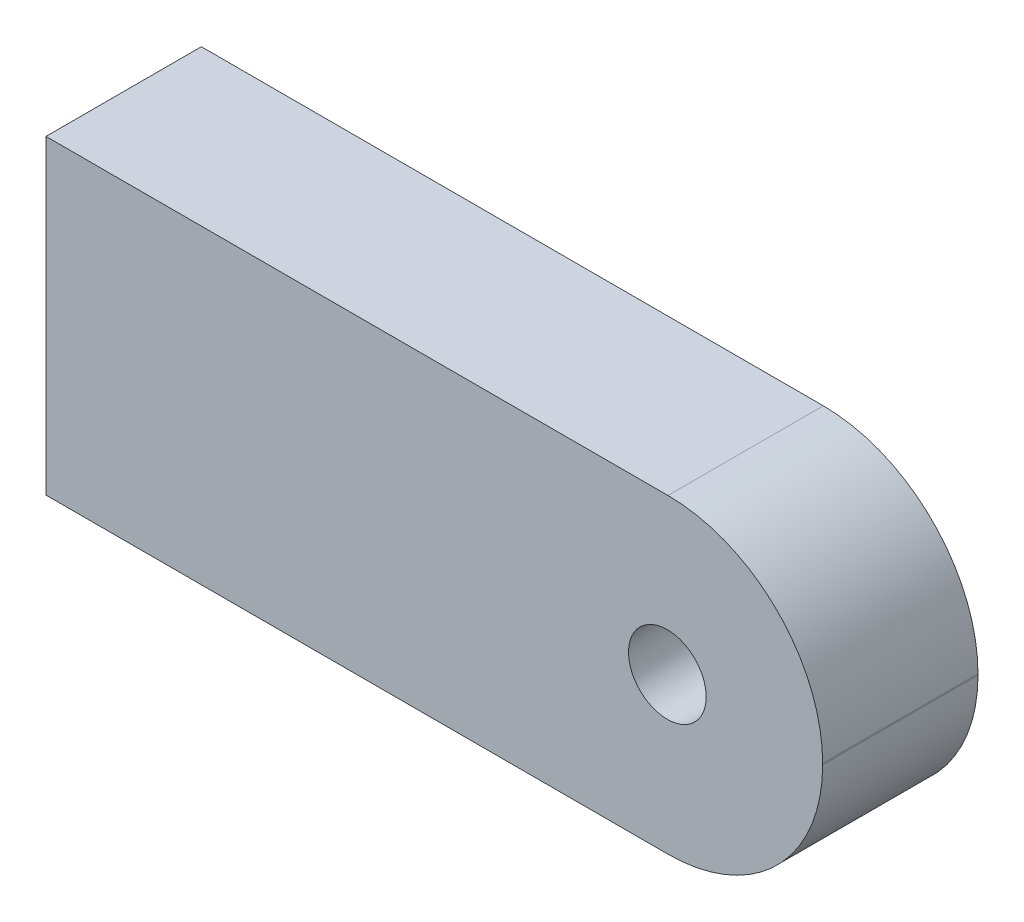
ISO-10303-21;
HEADER;
FILE_DESCRIPTION(('STEP AP214'),'2;1');
FILE_NAME('part.step','',(''),(''),'','','');
FILE_SCHEMA(('AUTOMOTIVE_DESIGN { 1 0 10303 214 1 1 1 1 }'));
ENDSEC;
DATA;
#1=APPLICATION_CONTEXT('core data for automotive mechanical design processes');
#2=APPLICATION_PROTOCOL_DEFINITION('international standard','automotive_design',2000,#1);
#3=PRODUCT_CONTEXT('',#1,'mechanical');
#4=PRODUCT('Part','Part','',(#3));
#5=PRODUCT_RELATED_PRODUCT_CATEGORY('part','',(#4));
#6=PRODUCT_DEFINITION_FORMATION('','',#4);
#7=PRODUCT_DEFINITION_CONTEXT('part definition',#1,'design');
#8=PRODUCT_DEFINITION('design','',#6,#7);
#9=PRODUCT_DEFINITION_SHAPE('','',#8);
#10=(LENGTH_UNIT() NAMED_UNIT(*) SI_UNIT(.MILLI.,.METRE.));
#11=(NAMED_UNIT(*) PLANE_ANGLE_UNIT() SI_UNIT($,.RADIAN.));
#12=(NAMED_UNIT(*) SI_UNIT($,.STERADIAN.) SOLID_ANGLE_UNIT());
#13=UNCERTAINTY_MEASURE_WITH_UNIT(LENGTH_MEASURE(1.E-05),#10,'distance_accuracy_value','');
#14=(GEOMETRIC_REPRESENTATION_CONTEXT(3) GLOBAL_UNCERTAINTY_ASSIGNED_CONTEXT((#13)) GLOBAL_UNIT_ASSIGNED_CONTEXT((#10,
#11,#12)) REPRESENTATION_CONTEXT('',''));
#15=CARTESIAN_POINT('',(0.,0.,0.));
#16=DIRECTION('',(0.,0.,1.));
#17=DIRECTION('',(1.,0.,0.));
#18=AXIS2_PLACEMENT_3D('',#15,#16,#17);
#19=CARTESIAN_POINT('',(0.0253999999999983,-0.0254000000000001,6.35));
#20=DIRECTION('',(0.,0.,1.));
#21=DIRECTION('',(1.,0.,0.));
#22=AXIS2_PLACEMENT_3D('',#19,#20,#21);
#23=PLANE('',#22);
#24=DIRECTION('',(0.,-1.,0.));
#25=VECTOR('',#24,1.);
#26=CARTESIAN_POINT('',(-25.4,6.35,6.35));
#27=LINE('',#26,#25);
#28=CARTESIAN_POINT('',(-25.4,6.35,6.35));
#29=VERTEX_POINT('',#28);
#30=CARTESIAN_POINT('',(-25.4,-6.35,6.35));
#31=VERTEX_POINT('',#30);
#32=EDGE_CURVE('E128',#29,#31,#27,.T.);
#33=ORIENTED_EDGE('',*,*,#32,.T.);
#34=DIRECTION('',(1.,0.,0.));
#35=VECTOR('',#34,1.);
#36=CARTESIAN_POINT('',(-25.4,-6.35,6.35));
#37=LINE('',#36,#35);
#38=CARTESIAN_POINT('',(0.0253999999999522,-6.35,6.35));
#39=VERTEX_POINT('',#38);
#40=EDGE_CURVE('E86',#31,#39,#37,.T.);
#41=ORIENTED_EDGE('',*,*,#40,.T.);
#42=CARTESIAN_POINT('',(0.0253999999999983,-0.0254000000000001,6.35));
#43=DIRECTION('',(0.,0.,1.));
#44=DIRECTION('',(1.,0.,0.));
#45=AXIS2_PLACEMENT_3D('',#42,#43,#44);
#46=CIRCLE('',#45,6.3246);
#47=CARTESIAN_POINT('',(6.35,-0.0253999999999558,6.35));
#48=VERTEX_POINT('',#47);
#49=EDGE_CURVE('E99',#39,#48,#46,.T.);
#50=ORIENTED_EDGE('',*,*,#49,.T.);
#51=DIRECTION('',(0.,1.,0.));
#52=VECTOR('',#51,1.);
#53=CARTESIAN_POINT('',(6.35,0.0253999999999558,6.35));
#54=LINE('',#53,#52);
#55=CARTESIAN_POINT('',(6.35,0.0253999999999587,6.35));
#56=VERTEX_POINT('',#55);
#57=EDGE_CURVE('E93',#48,#56,#54,.T.);
#58=ORIENTED_EDGE('',*,*,#57,.T.);
#59=CARTESIAN_POINT('',(0.0253999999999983,0.0254000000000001,6.35));
#60=DIRECTION('',(0.,0.,1.));
#61=DIRECTION('',(-1.,0.,0.));
#62=AXIS2_PLACEMENT_3D('',#59,#60,#61);
#63=CIRCLE('',#62,6.3246);
#64=CARTESIAN_POINT('',(0.0253999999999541,6.35,6.35));
#65=VERTEX_POINT('',#64);
#66=EDGE_CURVE('E97',#56,#65,#63,.T.);
#67=ORIENTED_EDGE('',*,*,#66,.T.);
#68=DIRECTION('',(-1.,0.,0.));
#69=VECTOR('',#68,1.);
#70=CARTESIAN_POINT('',(-25.4,6.35,6.35));
#71=LINE('',#70,#69);
#72=EDGE_CURVE('E49',#65,#29,#71,.T.);
#73=ORIENTED_EDGE('',*,*,#72,.T.);
#74=EDGE_LOOP('',(#33,#41,#50,#58,#67,#73));
#75=FACE_BOUND('',#74,.T.);
#76=CARTESIAN_POINT('',(0.,0.,6.35));
#77=DIRECTION('',(0.,0.,1.));
#78=DIRECTION('',(1.,0.,0.));
#79=AXIS2_PLACEMENT_3D('',#76,#77,#78);
#80=CIRCLE('',#79,1.5875);
#81=CARTESIAN_POINT('',(1.5875,0.,6.35));
#82=VERTEX_POINT('',#81);
#83=EDGE_CURVE('E121',#82,#82,#80,.T.);
#84=ORIENTED_EDGE('',*,*,#83,.F.);
#85=EDGE_LOOP('',(#84));
#86=FACE_BOUND('',#85,.T.);
#87=ADVANCED_FACE('F32',(#75,#86),#23,.T.);
#88=CARTESIAN_POINT('',(0.0253999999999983,-0.0254000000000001,0.));
#89=DIRECTION('',(0.,0.,1.));
#90=DIRECTION('',(1.,0.,0.));
#91=AXIS2_PLACEMENT_3D('',#88,#89,#90);
#92=PLANE('',#91);
#93=DIRECTION('',(0.,-1.,0.));
#94=VECTOR('',#93,1.);
#95=CARTESIAN_POINT('',(-25.4,6.35,0.));
#96=LINE('',#95,#94);
#97=CARTESIAN_POINT('',(-25.4,6.35,0.));
#98=VERTEX_POINT('',#97);
#99=CARTESIAN_POINT('',(-25.4,-6.35,0.));
#100=VERTEX_POINT('',#99);
#101=EDGE_CURVE('E117',#98,#100,#96,.T.);
#102=ORIENTED_EDGE('',*,*,#101,.F.);
#103=DIRECTION('',(-1.,0.,0.));
#104=VECTOR('',#103,1.);
#105=CARTESIAN_POINT('',(-25.4,6.35,0.));
#106=LINE('',#105,#104);
#107=CARTESIAN_POINT('',(0.0253999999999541,6.35,0.));
#108=VERTEX_POINT('',#107);
#109=EDGE_CURVE('E78',#108,#98,#106,.T.);
#110=ORIENTED_EDGE('',*,*,#109,.F.);
#111=CARTESIAN_POINT('',(0.0253999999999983,0.0254000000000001,0.));
#112=DIRECTION('',(0.,0.,1.));
#113=DIRECTION('',(-1.,0.,0.));
#114=AXIS2_PLACEMENT_3D('',#111,#112,#113);
#115=CIRCLE('',#114,6.3246);
#116=CARTESIAN_POINT('',(6.35,0.0253999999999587,0.));
#117=VERTEX_POINT('',#116);
#118=EDGE_CURVE('E72',#117,#108,#115,.T.);
#119=ORIENTED_EDGE('',*,*,#118,.F.);
#120=DIRECTION('',(0.,1.,0.));
#121=VECTOR('',#120,1.);
#122=CARTESIAN_POINT('',(6.35,0.0253999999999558,0.));
#123=LINE('',#122,#121);
#124=CARTESIAN_POINT('',(6.35,-0.0253999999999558,0.));
#125=VERTEX_POINT('',#124);
#126=EDGE_CURVE('E107',#125,#117,#123,.T.);
#127=ORIENTED_EDGE('',*,*,#126,.F.);
#128=CARTESIAN_POINT('',(0.0253999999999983,-0.0254000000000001,0.));
#129=DIRECTION('',(0.,0.,1.));
#130=DIRECTION('',(1.,0.,0.));
#131=AXIS2_PLACEMENT_3D('',#128,#129,#130);
#132=CIRCLE('',#131,6.3246);
#133=CARTESIAN_POINT('',(0.0253999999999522,-6.35,0.));
#134=VERTEX_POINT('',#133);
#135=EDGE_CURVE('E123',#134,#125,#132,.T.);
#136=ORIENTED_EDGE('',*,*,#135,.F.);
#137=DIRECTION('',(1.,0.,0.));
#138=VECTOR('',#137,1.);
#139=CARTESIAN_POINT('',(-25.4,-6.35,0.));
#140=LINE('',#139,#138);
#141=EDGE_CURVE('E120',#100,#134,#140,.T.);
#142=ORIENTED_EDGE('',*,*,#141,.F.);
#143=EDGE_LOOP('',(#102,#110,#119,#127,#136,#142));
#144=FACE_BOUND('',#143,.T.);
#145=CARTESIAN_POINT('',(0.,0.,0.));
#146=DIRECTION('',(0.,0.,1.));
#147=DIRECTION('',(1.,0.,0.));
#148=AXIS2_PLACEMENT_3D('',#145,#146,#147);
#149=CIRCLE('',#148,1.5875);
#150=CARTESIAN_POINT('',(1.5875,0.,0.));
#151=VERTEX_POINT('',#150);
#152=EDGE_CURVE('E221',#151,#151,#149,.T.);
#153=ORIENTED_EDGE('',*,*,#152,.T.);
#154=EDGE_LOOP('',(#153));
#155=FACE_BOUND('',#154,.T.);
#156=ADVANCED_FACE('F137',(#144,#155),#92,.F.);
#157=CARTESIAN_POINT('',(-25.4,6.35,6.35));
#158=DIRECTION('',(1.,0.,0.));
#159=DIRECTION('',(0.,0.,-1.));
#160=AXIS2_PLACEMENT_3D('',#157,#158,#159);
#161=PLANE('',#160);
#162=ORIENTED_EDGE('',*,*,#101,.T.);
#163=DIRECTION('',(0.,0.,-1.));
#164=VECTOR('',#163,1.);
#165=CARTESIAN_POINT('',(-25.4,-6.35,6.35));
#166=LINE('',#165,#164);
#167=EDGE_CURVE('E11',#31,#100,#166,.T.);
#168=ORIENTED_EDGE('',*,*,#167,.F.);
#169=ORIENTED_EDGE('',*,*,#32,.F.);
#170=DIRECTION('',(0.,0.,-1.));
#171=VECTOR('',#170,1.);
#172=CARTESIAN_POINT('',(-25.4,6.35,6.35));
#173=LINE('',#172,#171);
#174=EDGE_CURVE('E113',#29,#98,#173,.T.);
#175=ORIENTED_EDGE('',*,*,#174,.T.);
#176=EDGE_LOOP('',(#162,#168,#169,#175));
#177=FACE_BOUND('',#176,.T.);
#178=ADVANCED_FACE('F34',(#177),#161,.F.);
#179=CARTESIAN_POINT('',(-25.4,-6.35,6.35));
#180=DIRECTION('',(0.,1.,0.));
#181=DIRECTION('',(0.,0.,1.));
#182=AXIS2_PLACEMENT_3D('',#179,#180,#181);
#183=PLANE('',#182);
#184=ORIENTED_EDGE('',*,*,#141,.T.);
#185=DIRECTION('',(0.,0.,-1.));
#186=VECTOR('',#185,1.);
#187=CARTESIAN_POINT('',(0.0253999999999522,-6.35,6.35));
#188=LINE('',#187,#186);
#189=EDGE_CURVE('E41',#39,#134,#188,.T.);
#190=ORIENTED_EDGE('',*,*,#189,.F.);
#191=ORIENTED_EDGE('',*,*,#40,.F.);
#192=ORIENTED_EDGE('',*,*,#167,.T.);
#193=EDGE_LOOP('',(#184,#190,#191,#192));
#194=FACE_BOUND('',#193,.T.);
#195=ADVANCED_FACE('F162',(#194),#183,.F.);
#196=CARTESIAN_POINT('',(0.0253999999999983,-0.0254000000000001,6.35));
#197=DIRECTION('',(0.,0.,-1.));
#198=DIRECTION('',(-1.,0.,0.));
#199=AXIS2_PLACEMENT_3D('',#196,#197,#198);
#200=CYLINDRICAL_SURFACE('',#199,6.3246);
#201=ORIENTED_EDGE('',*,*,#135,.T.);
#202=DIRECTION('',(0.,0.,-1.));
#203=VECTOR('',#202,1.);
#204=CARTESIAN_POINT('',(6.35,-0.0253999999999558,6.35));
#205=LINE('',#204,#203);
#206=EDGE_CURVE('E108',#48,#125,#205,.T.);
#207=ORIENTED_EDGE('',*,*,#206,.F.);
#208=ORIENTED_EDGE('',*,*,#49,.F.);
#209=ORIENTED_EDGE('',*,*,#189,.T.);
#210=EDGE_LOOP('',(#201,#207,#208,#209));
#211=FACE_BOUND('',#210,.T.);
#212=ADVANCED_FACE('F134',(#211),#200,.T.);
#213=CARTESIAN_POINT('',(6.35,0.0253999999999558,6.35));
#214=DIRECTION('',(-1.,0.,0.));
#215=DIRECTION('',(0.,0.,1.));
#216=AXIS2_PLACEMENT_3D('',#213,#214,#215);
#217=PLANE('',#216);
#218=ORIENTED_EDGE('',*,*,#126,.T.);
#219=DIRECTION('',(0.,0.,-1.));
#220=VECTOR('',#219,1.);
#221=CARTESIAN_POINT('',(6.35,0.0253999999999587,6.35));
#222=LINE('',#221,#220);
#223=EDGE_CURVE('E104',#56,#117,#222,.T.);
#224=ORIENTED_EDGE('',*,*,#223,.F.);
#225=ORIENTED_EDGE('',*,*,#57,.F.);
#226=ORIENTED_EDGE('',*,*,#206,.T.);
#227=EDGE_LOOP('',(#218,#224,#225,#226));
#228=FACE_BOUND('',#227,.T.);
#229=ADVANCED_FACE('F105',(#228),#217,.F.);
#230=CARTESIAN_POINT('',(0.0253999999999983,0.0254000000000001,6.35));
#231=DIRECTION('',(0.,0.,-1.));
#232=DIRECTION('',(-1.,0.,0.));
#233=AXIS2_PLACEMENT_3D('',#230,#231,#232);
#234=CYLINDRICAL_SURFACE('',#233,6.3246);
#235=ORIENTED_EDGE('',*,*,#118,.T.);
#236=DIRECTION('',(0.,0.,-1.));
#237=VECTOR('',#236,1.);
#238=CARTESIAN_POINT('',(0.0253999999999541,6.35,6.35));
#239=LINE('',#238,#237);
#240=EDGE_CURVE('E109',#65,#108,#239,.T.);
#241=ORIENTED_EDGE('',*,*,#240,.F.);
#242=ORIENTED_EDGE('',*,*,#66,.F.);
#243=ORIENTED_EDGE('',*,*,#223,.T.);
#244=EDGE_LOOP('',(#235,#241,#242,#243));
#245=FACE_BOUND('',#244,.T.);
#246=ADVANCED_FACE('F111',(#245),#234,.T.);
#247=CARTESIAN_POINT('',(-25.4,6.35,6.35));
#248=DIRECTION('',(0.,-1.,0.));
#249=DIRECTION('',(0.,0.,-1.));
#250=AXIS2_PLACEMENT_3D('',#247,#248,#249);
#251=PLANE('',#250);
#252=ORIENTED_EDGE('',*,*,#109,.T.);
#253=ORIENTED_EDGE('',*,*,#174,.F.);
#254=ORIENTED_EDGE('',*,*,#72,.F.);
#255=ORIENTED_EDGE('',*,*,#240,.T.);
#256=EDGE_LOOP('',(#252,#253,#254,#255));
#257=FACE_BOUND('',#256,.T.);
#258=ADVANCED_FACE('F142',(#257),#251,.F.);
#259=CARTESIAN_POINT('',(0.,0.,6.35));
#260=DIRECTION('',(0.,0.,-1.));
#261=DIRECTION('',(-1.,0.,0.));
#262=AXIS2_PLACEMENT_3D('',#259,#260,#261);
#263=CYLINDRICAL_SURFACE('',#262,1.5875);
#264=ORIENTED_EDGE('',*,*,#83,.T.);
#265=EDGE_LOOP('',(#264));
#266=FACE_BOUND('',#265,.T.);
#267=ORIENTED_EDGE('',*,*,#152,.F.);
#268=EDGE_LOOP('',(#267));
#269=FACE_BOUND('',#268,.T.);
#270=ADVANCED_FACE('F144',(#266,#269),#263,.F.);
#271=CLOSED_SHELL('',(#87,#156,#178,#195,#212,#229,#246,#258,#270));
#272=MANIFOLD_SOLID_BREP('B2',#271);
#273=ADVANCED_BREP_SHAPE_REPRESENTATION('',(#18,#272),#14);
#274=SHAPE_DEFINITION_REPRESENTATION(#9,#273);
ENDSEC;
END-ISO-10303-21;
